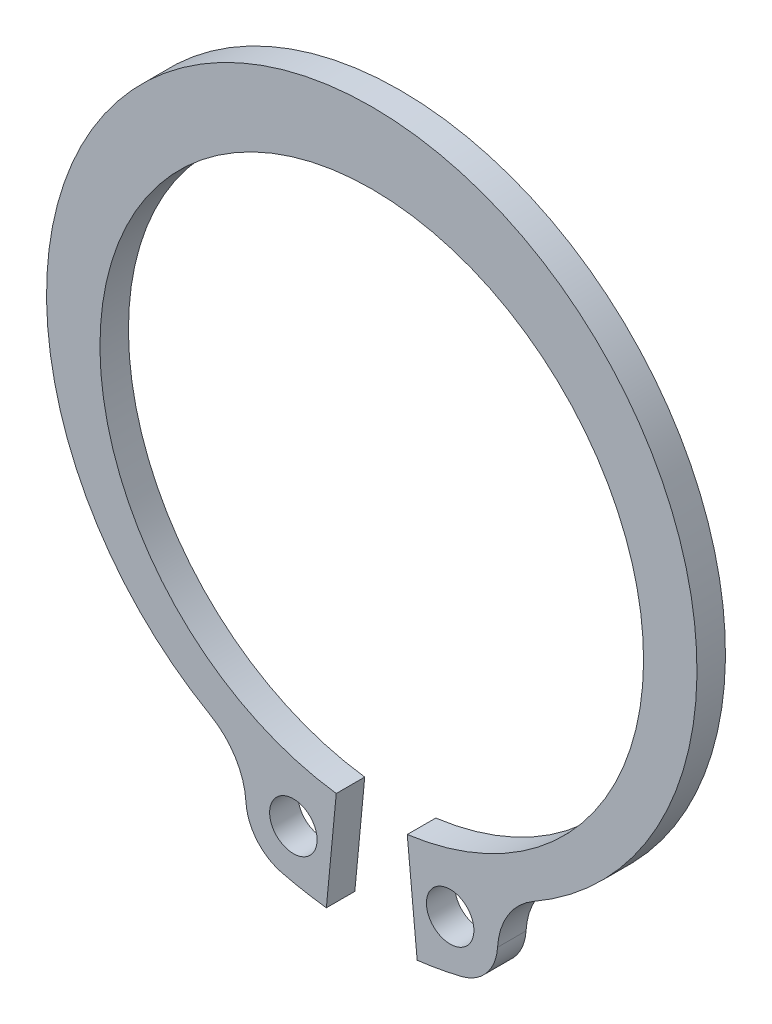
ISO-10303-21;
HEADER;
FILE_DESCRIPTION(('STEP AP214'),'2;1');
FILE_NAME('part.step','',(''),(''),'','','');
FILE_SCHEMA(('AUTOMOTIVE_DESIGN { 1 0 10303 214 1 1 1 1 }'));
ENDSEC;
DATA;
#1=APPLICATION_CONTEXT('core data for automotive mechanical design processes');
#2=APPLICATION_PROTOCOL_DEFINITION('international standard','automotive_design',2000,#1);
#3=PRODUCT_CONTEXT('',#1,'mechanical');
#4=PRODUCT('Part','Part','',(#3));
#5=PRODUCT_RELATED_PRODUCT_CATEGORY('part','',(#4));
#6=PRODUCT_DEFINITION_FORMATION('','',#4);
#7=PRODUCT_DEFINITION_CONTEXT('part definition',#1,'design');
#8=PRODUCT_DEFINITION('design','',#6,#7);
#9=PRODUCT_DEFINITION_SHAPE('','',#8);
#10=(LENGTH_UNIT() NAMED_UNIT(*) SI_UNIT(.MILLI.,.METRE.));
#11=(NAMED_UNIT(*) PLANE_ANGLE_UNIT() SI_UNIT($,.RADIAN.));
#12=(NAMED_UNIT(*) SI_UNIT($,.STERADIAN.) SOLID_ANGLE_UNIT());
#13=UNCERTAINTY_MEASURE_WITH_UNIT(LENGTH_MEASURE(1.E-05),#10,'distance_accuracy_value','');
#14=(GEOMETRIC_REPRESENTATION_CONTEXT(3) GLOBAL_UNCERTAINTY_ASSIGNED_CONTEXT((#13)) GLOBAL_UNIT_ASSIGNED_CONTEXT((#10,
#11,#12)) REPRESENTATION_CONTEXT('',''));
#15=CARTESIAN_POINT('',(0.,0.,0.));
#16=DIRECTION('',(0.,0.,1.));
#17=DIRECTION('',(1.,0.,0.));
#18=AXIS2_PLACEMENT_3D('',#15,#16,#17);
#19=CARTESIAN_POINT('',(0.,0.,1.2));
#20=DIRECTION('',(0.,0.,1.));
#21=DIRECTION('',(1.,0.,0.));
#22=AXIS2_PLACEMENT_3D('',#19,#20,#21);
#23=PLANE('',#22);
#24=CARTESIAN_POINT('',(-3.30221734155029,-13.4484450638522,1.2));
#25=DIRECTION('',(0.,0.,1.));
#26=DIRECTION('',(-1.,0.,0.));
#27=AXIS2_PLACEMENT_3D('',#24,#25,#26);
#28=CIRCLE('',#27,1.);
#29=CARTESIAN_POINT('',(-4.30221734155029,-13.4484450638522,1.2));
#30=VERTEX_POINT('',#29);
#31=EDGE_CURVE('E133',#30,#30,#28,.T.);
#32=ORIENTED_EDGE('',*,*,#31,.F.);
#33=EDGE_LOOP('',(#32));
#34=FACE_BOUND('',#33,.T.);
#35=CARTESIAN_POINT('',(0.,0.,1.2));
#36=DIRECTION('',(0.,0.,-1.));
#37=DIRECTION('',(1.,0.,0.));
#38=AXIS2_PLACEMENT_3D('',#35,#36,#37);
#39=CIRCLE('',#38,11.45);
#40=CARTESIAN_POINT('',(-1.49536024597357,-11.3519336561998,1.2));
#41=VERTEX_POINT('',#40);
#42=CARTESIAN_POINT('',(1.49536024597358,-11.3519336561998,1.2));
#43=VERTEX_POINT('',#42);
#44=EDGE_CURVE('E155',#41,#43,#39,.T.);
#45=ORIENTED_EDGE('',*,*,#44,.T.);
#46=DIRECTION('',(0.0947869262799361,-0.995497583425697,0.));
#47=VECTOR('',#46,1.);
#48=CARTESIAN_POINT('',(1.49536024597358,-11.3519336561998,1.2));
#49=LINE('',#48,#47);
#50=CARTESIAN_POINT('',(1.9124227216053,-15.7321230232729,1.2));
#51=VERTEX_POINT('',#50);
#52=EDGE_CURVE('E128',#43,#51,#49,.T.);
#53=ORIENTED_EDGE('',*,*,#52,.T.);
#54=CARTESIAN_POINT('',(0.,0.,1.2));
#55=DIRECTION('',(0.,0.,1.));
#56=DIRECTION('',(1.,0.,0.));
#57=AXIS2_PLACEMENT_3D('',#54,#55,#56);
#58=CIRCLE('',#57,15.8479353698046);
#59=CARTESIAN_POINT('',(3.77914292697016,-15.3907483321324,1.2));
#60=VERTEX_POINT('',#59);
#61=EDGE_CURVE('E159',#51,#60,#58,.T.);
#62=ORIENTED_EDGE('',*,*,#61,.T.);
#63=CARTESIAN_POINT('',(3.30221734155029,-13.4484450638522,1.2));
#64=DIRECTION('',(0.,0.,1.));
#65=DIRECTION('',(1.,0.,0.));
#66=AXIS2_PLACEMENT_3D('',#63,#64,#65);
#67=CIRCLE('',#66,2.);
#68=CARTESIAN_POINT('',(5.29869284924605,-13.5671276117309,1.2));
#69=VERTEX_POINT('',#68);
#70=EDGE_CURVE('E161',#60,#69,#67,.T.);
#71=ORIENTED_EDGE('',*,*,#70,.T.);
#72=CARTESIAN_POINT('',(8.29340611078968,-13.745151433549,1.2));
#73=DIRECTION('',(0.,0.,-1.));
#74=DIRECTION('',(1.,0.,0.));
#75=AXIS2_PLACEMENT_3D('',#72,#73,#74);
#76=CIRCLE('',#75,3.);
#77=CARTESIAN_POINT('',(6.80357267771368,-11.1412320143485,1.2));
#78=VERTEX_POINT('',#77);
#79=EDGE_CURVE('E163',#69,#78,#76,.T.);
#80=ORIENTED_EDGE('',*,*,#79,.T.);
#81=CARTESIAN_POINT('',(0.,0.75,1.2));
#82=DIRECTION('',(0.,0.,1.));
#83=DIRECTION('',(1.,0.,0.));
#84=AXIS2_PLACEMENT_3D('',#81,#82,#83);
#85=CIRCLE('',#84,13.7);
#86=CARTESIAN_POINT('',(-6.80357267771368,-11.1412320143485,1.2));
#87=VERTEX_POINT('',#86);
#88=EDGE_CURVE('E165',#78,#87,#85,.T.);
#89=ORIENTED_EDGE('',*,*,#88,.T.);
#90=CARTESIAN_POINT('',(-8.29340611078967,-13.745151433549,1.2));
#91=DIRECTION('',(0.,0.,-1.));
#92=DIRECTION('',(-1.,0.,0.));
#93=AXIS2_PLACEMENT_3D('',#90,#91,#92);
#94=CIRCLE('',#93,3.);
#95=CARTESIAN_POINT('',(-5.29869284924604,-13.5671276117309,1.2));
#96=VERTEX_POINT('',#95);
#97=EDGE_CURVE('E168',#87,#96,#94,.T.);
#98=ORIENTED_EDGE('',*,*,#97,.T.);
#99=CARTESIAN_POINT('',(-3.30221734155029,-13.4484450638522,1.2));
#100=DIRECTION('',(0.,0.,1.));
#101=DIRECTION('',(-1.,0.,0.));
#102=AXIS2_PLACEMENT_3D('',#99,#100,#101);
#103=CIRCLE('',#102,2.);
#104=CARTESIAN_POINT('',(-3.77914292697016,-15.3907483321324,1.2));
#105=VERTEX_POINT('',#104);
#106=EDGE_CURVE('E170',#96,#105,#103,.T.);
#107=ORIENTED_EDGE('',*,*,#106,.T.);
#108=CARTESIAN_POINT('',(0.,0.,1.2));
#109=DIRECTION('',(0.,0.,1.));
#110=DIRECTION('',(-1.,0.,0.));
#111=AXIS2_PLACEMENT_3D('',#108,#109,#110);
#112=CIRCLE('',#111,15.8479353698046);
#113=CARTESIAN_POINT('',(-1.91242272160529,-15.7321230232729,1.2));
#114=VERTEX_POINT('',#113);
#115=EDGE_CURVE('E57',#105,#114,#112,.T.);
#116=ORIENTED_EDGE('',*,*,#115,.T.);
#117=DIRECTION('',(0.0947869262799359,0.995497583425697,0.));
#118=VECTOR('',#117,1.);
#119=CARTESIAN_POINT('',(-1.49536024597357,-11.3519336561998,1.2));
#120=LINE('',#119,#118);
#121=EDGE_CURVE('E52',#114,#41,#120,.T.);
#122=ORIENTED_EDGE('',*,*,#121,.T.);
#123=EDGE_LOOP('',(#45,#53,#62,#71,#80,#89,#98,#107,#116,#122));
#124=FACE_BOUND('',#123,.T.);
#125=CARTESIAN_POINT('',(3.30221734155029,-13.4484450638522,1.2));
#126=DIRECTION('',(0.,0.,1.));
#127=DIRECTION('',(1.,0.,0.));
#128=AXIS2_PLACEMENT_3D('',#125,#126,#127);
#129=CIRCLE('',#128,1.);
#130=CARTESIAN_POINT('',(4.30221734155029,-13.4484450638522,1.2));
#131=VERTEX_POINT('',#130);
#132=EDGE_CURVE('E257',#131,#131,#129,.T.);
#133=ORIENTED_EDGE('',*,*,#132,.F.);
#134=EDGE_LOOP('',(#133));
#135=FACE_BOUND('',#134,.T.);
#136=ADVANCED_FACE('F37',(#34,#124,#135),#23,.T.);
#137=CARTESIAN_POINT('',(0.,0.,0.));
#138=DIRECTION('',(0.,0.,1.));
#139=DIRECTION('',(1.,0.,0.));
#140=AXIS2_PLACEMENT_3D('',#137,#138,#139);
#141=PLANE('',#140);
#142=CARTESIAN_POINT('',(-3.30221734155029,-13.4484450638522,0.));
#143=DIRECTION('',(0.,0.,1.));
#144=DIRECTION('',(-1.,0.,0.));
#145=AXIS2_PLACEMENT_3D('',#142,#143,#144);
#146=CIRCLE('',#145,1.);
#147=CARTESIAN_POINT('',(-4.30221734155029,-13.4484450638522,0.));
#148=VERTEX_POINT('',#147);
#149=EDGE_CURVE('E136',#148,#148,#146,.T.);
#150=ORIENTED_EDGE('',*,*,#149,.T.);
#151=EDGE_LOOP('',(#150));
#152=FACE_BOUND('',#151,.T.);
#153=CARTESIAN_POINT('',(0.,0.,0.));
#154=DIRECTION('',(0.,0.,-1.));
#155=DIRECTION('',(1.,0.,0.));
#156=AXIS2_PLACEMENT_3D('',#153,#154,#155);
#157=CIRCLE('',#156,11.45);
#158=CARTESIAN_POINT('',(-1.49536024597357,-11.3519336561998,0.));
#159=VERTEX_POINT('',#158);
#160=CARTESIAN_POINT('',(1.49536024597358,-11.3519336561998,0.));
#161=VERTEX_POINT('',#160);
#162=EDGE_CURVE('E119',#159,#161,#157,.T.);
#163=ORIENTED_EDGE('',*,*,#162,.F.);
#164=DIRECTION('',(0.0947869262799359,0.995497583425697,0.));
#165=VECTOR('',#164,1.);
#166=CARTESIAN_POINT('',(-1.49536024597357,-11.3519336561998,0.));
#167=LINE('',#166,#165);
#168=CARTESIAN_POINT('',(-1.91242272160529,-15.7321230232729,0.));
#169=VERTEX_POINT('',#168);
#170=EDGE_CURVE('E153',#169,#159,#167,.T.);
#171=ORIENTED_EDGE('',*,*,#170,.F.);
#172=CARTESIAN_POINT('',(0.,0.,0.));
#173=DIRECTION('',(0.,0.,1.));
#174=DIRECTION('',(-1.,0.,0.));
#175=AXIS2_PLACEMENT_3D('',#172,#173,#174);
#176=CIRCLE('',#175,15.8479353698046);
#177=CARTESIAN_POINT('',(-3.77914292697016,-15.3907483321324,0.));
#178=VERTEX_POINT('',#177);
#179=EDGE_CURVE('E151',#178,#169,#176,.T.);
#180=ORIENTED_EDGE('',*,*,#179,.F.);
#181=CARTESIAN_POINT('',(-3.30221734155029,-13.4484450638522,0.));
#182=DIRECTION('',(0.,0.,1.));
#183=DIRECTION('',(-1.,0.,0.));
#184=AXIS2_PLACEMENT_3D('',#181,#182,#183);
#185=CIRCLE('',#184,2.);
#186=CARTESIAN_POINT('',(-5.29869284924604,-13.5671276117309,0.));
#187=VERTEX_POINT('',#186);
#188=EDGE_CURVE('E149',#187,#178,#185,.T.);
#189=ORIENTED_EDGE('',*,*,#188,.F.);
#190=CARTESIAN_POINT('',(-8.29340611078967,-13.745151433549,0.));
#191=DIRECTION('',(0.,0.,-1.));
#192=DIRECTION('',(-1.,0.,0.));
#193=AXIS2_PLACEMENT_3D('',#190,#191,#192);
#194=CIRCLE('',#193,3.);
#195=CARTESIAN_POINT('',(-6.80357267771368,-11.1412320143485,0.));
#196=VERTEX_POINT('',#195);
#197=EDGE_CURVE('E147',#196,#187,#194,.T.);
#198=ORIENTED_EDGE('',*,*,#197,.F.);
#199=CARTESIAN_POINT('',(0.,0.75,0.));
#200=DIRECTION('',(0.,0.,1.));
#201=DIRECTION('',(1.,0.,0.));
#202=AXIS2_PLACEMENT_3D('',#199,#200,#201);
#203=CIRCLE('',#202,13.7);
#204=CARTESIAN_POINT('',(6.80357267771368,-11.1412320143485,0.));
#205=VERTEX_POINT('',#204);
#206=EDGE_CURVE('E145',#205,#196,#203,.T.);
#207=ORIENTED_EDGE('',*,*,#206,.F.);
#208=CARTESIAN_POINT('',(8.29340611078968,-13.745151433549,0.));
#209=DIRECTION('',(0.,0.,-1.));
#210=DIRECTION('',(1.,0.,0.));
#211=AXIS2_PLACEMENT_3D('',#208,#209,#210);
#212=CIRCLE('',#211,3.);
#213=CARTESIAN_POINT('',(5.29869284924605,-13.5671276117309,0.));
#214=VERTEX_POINT('',#213);
#215=EDGE_CURVE('E143',#214,#205,#212,.T.);
#216=ORIENTED_EDGE('',*,*,#215,.F.);
#217=CARTESIAN_POINT('',(3.30221734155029,-13.4484450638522,0.));
#218=DIRECTION('',(0.,0.,1.));
#219=DIRECTION('',(1.,0.,0.));
#220=AXIS2_PLACEMENT_3D('',#217,#218,#219);
#221=CIRCLE('',#220,2.);
#222=CARTESIAN_POINT('',(3.77914292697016,-15.3907483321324,0.));
#223=VERTEX_POINT('',#222);
#224=EDGE_CURVE('E141',#223,#214,#221,.T.);
#225=ORIENTED_EDGE('',*,*,#224,.F.);
#226=CARTESIAN_POINT('',(0.,0.,0.));
#227=DIRECTION('',(0.,0.,1.));
#228=DIRECTION('',(1.,0.,0.));
#229=AXIS2_PLACEMENT_3D('',#226,#227,#228);
#230=CIRCLE('',#229,15.8479353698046);
#231=CARTESIAN_POINT('',(1.9124227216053,-15.7321230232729,0.));
#232=VERTEX_POINT('',#231);
#233=EDGE_CURVE('E121',#232,#223,#230,.T.);
#234=ORIENTED_EDGE('',*,*,#233,.F.);
#235=DIRECTION('',(0.0947869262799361,-0.995497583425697,0.));
#236=VECTOR('',#235,1.);
#237=CARTESIAN_POINT('',(1.49536024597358,-11.3519336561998,0.));
#238=LINE('',#237,#236);
#239=EDGE_CURVE('E114',#161,#232,#238,.T.);
#240=ORIENTED_EDGE('',*,*,#239,.F.);
#241=EDGE_LOOP('',(#163,#171,#180,#189,#198,#207,#216,#225,#234,#240));
#242=FACE_BOUND('',#241,.T.);
#243=CARTESIAN_POINT('',(3.30221734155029,-13.4484450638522,0.));
#244=DIRECTION('',(0.,0.,1.));
#245=DIRECTION('',(1.,0.,0.));
#246=AXIS2_PLACEMENT_3D('',#243,#244,#245);
#247=CIRCLE('',#246,1.);
#248=CARTESIAN_POINT('',(4.30221734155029,-13.4484450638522,0.));
#249=VERTEX_POINT('',#248);
#250=EDGE_CURVE('E260',#249,#249,#247,.T.);
#251=ORIENTED_EDGE('',*,*,#250,.T.);
#252=EDGE_LOOP('',(#251));
#253=FACE_BOUND('',#252,.T.);
#254=ADVANCED_FACE('F115',(#152,#242,#253),#141,.F.);
#255=CARTESIAN_POINT('',(0.,0.,1.2));
#256=DIRECTION('',(0.,0.,-1.));
#257=DIRECTION('',(-1.,0.,0.));
#258=AXIS2_PLACEMENT_3D('',#255,#256,#257);
#259=CYLINDRICAL_SURFACE('',#258,11.45);
#260=ORIENTED_EDGE('',*,*,#162,.T.);
#261=DIRECTION('',(0.,0.,-1.));
#262=VECTOR('',#261,1.);
#263=CARTESIAN_POINT('',(1.49536024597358,-11.3519336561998,1.2));
#264=LINE('',#263,#262);
#265=EDGE_CURVE('E11',#43,#161,#264,.T.);
#266=ORIENTED_EDGE('',*,*,#265,.F.);
#267=ORIENTED_EDGE('',*,*,#44,.F.);
#268=DIRECTION('',(0.,0.,-1.));
#269=VECTOR('',#268,1.);
#270=CARTESIAN_POINT('',(-1.49536024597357,-11.3519336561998,1.2));
#271=LINE('',#270,#269);
#272=EDGE_CURVE('E132',#41,#159,#271,.T.);
#273=ORIENTED_EDGE('',*,*,#272,.T.);
#274=EDGE_LOOP('',(#260,#266,#267,#273));
#275=FACE_BOUND('',#274,.T.);
#276=ADVANCED_FACE('F39',(#275),#259,.F.);
#277=CARTESIAN_POINT('',(1.49536024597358,-11.3519336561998,1.2));
#278=DIRECTION('',(0.995497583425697,0.0947869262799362,0.));
#279=DIRECTION('',(-0.0947869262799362,0.995497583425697,0.));
#280=AXIS2_PLACEMENT_3D('',#277,#278,#279);
#281=PLANE('',#280);
#282=ORIENTED_EDGE('',*,*,#239,.T.);
#283=DIRECTION('',(0.,0.,-1.));
#284=VECTOR('',#283,1.);
#285=CARTESIAN_POINT('',(1.9124227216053,-15.7321230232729,1.2));
#286=LINE('',#285,#284);
#287=EDGE_CURVE('E45',#51,#232,#286,.T.);
#288=ORIENTED_EDGE('',*,*,#287,.F.);
#289=ORIENTED_EDGE('',*,*,#52,.F.);
#290=ORIENTED_EDGE('',*,*,#265,.T.);
#291=EDGE_LOOP('',(#282,#288,#289,#290));
#292=FACE_BOUND('',#291,.T.);
#293=ADVANCED_FACE('F127',(#292),#281,.F.);
#294=CARTESIAN_POINT('',(0.,0.,1.2));
#295=DIRECTION('',(0.,0.,-1.));
#296=DIRECTION('',(-1.,0.,0.));
#297=AXIS2_PLACEMENT_3D('',#294,#295,#296);
#298=CYLINDRICAL_SURFACE('',#297,15.8479353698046);
#299=ORIENTED_EDGE('',*,*,#233,.T.);
#300=DIRECTION('',(0.,0.,-1.));
#301=VECTOR('',#300,1.);
#302=CARTESIAN_POINT('',(3.77914292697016,-15.3907483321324,1.2));
#303=LINE('',#302,#301);
#304=EDGE_CURVE('E193',#60,#223,#303,.T.);
#305=ORIENTED_EDGE('',*,*,#304,.F.);
#306=ORIENTED_EDGE('',*,*,#61,.F.);
#307=ORIENTED_EDGE('',*,*,#287,.T.);
#308=EDGE_LOOP('',(#299,#305,#306,#307));
#309=FACE_BOUND('',#308,.T.);
#310=ADVANCED_FACE('F197',(#309),#298,.T.);
#311=CARTESIAN_POINT('',(3.30221734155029,-13.4484450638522,1.2));
#312=DIRECTION('',(0.,0.,-1.));
#313=DIRECTION('',(-1.,0.,0.));
#314=AXIS2_PLACEMENT_3D('',#311,#312,#313);
#315=CYLINDRICAL_SURFACE('',#314,2.);
#316=ORIENTED_EDGE('',*,*,#224,.T.);
#317=DIRECTION('',(0.,0.,-1.));
#318=VECTOR('',#317,1.);
#319=CARTESIAN_POINT('',(5.29869284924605,-13.5671276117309,1.2));
#320=LINE('',#319,#318);
#321=EDGE_CURVE('E190',#69,#214,#320,.T.);
#322=ORIENTED_EDGE('',*,*,#321,.F.);
#323=ORIENTED_EDGE('',*,*,#70,.F.);
#324=ORIENTED_EDGE('',*,*,#304,.T.);
#325=EDGE_LOOP('',(#316,#322,#323,#324));
#326=FACE_BOUND('',#325,.T.);
#327=ADVANCED_FACE('F205',(#326),#315,.T.);
#328=CARTESIAN_POINT('',(8.29340611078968,-13.745151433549,1.2));
#329=DIRECTION('',(0.,0.,-1.));
#330=DIRECTION('',(-1.,0.,0.));
#331=AXIS2_PLACEMENT_3D('',#328,#329,#330);
#332=CYLINDRICAL_SURFACE('',#331,3.);
#333=ORIENTED_EDGE('',*,*,#215,.T.);
#334=DIRECTION('',(0.,0.,-1.));
#335=VECTOR('',#334,1.);
#336=CARTESIAN_POINT('',(6.80357267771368,-11.1412320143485,1.2));
#337=LINE('',#336,#335);
#338=EDGE_CURVE('E187',#78,#205,#337,.T.);
#339=ORIENTED_EDGE('',*,*,#338,.F.);
#340=ORIENTED_EDGE('',*,*,#79,.F.);
#341=ORIENTED_EDGE('',*,*,#321,.T.);
#342=EDGE_LOOP('',(#333,#339,#340,#341));
#343=FACE_BOUND('',#342,.T.);
#344=ADVANCED_FACE('F208',(#343),#332,.F.);
#345=CARTESIAN_POINT('',(0.,0.75,1.2));
#346=DIRECTION('',(0.,0.,-1.));
#347=DIRECTION('',(-1.,0.,0.));
#348=AXIS2_PLACEMENT_3D('',#345,#346,#347);
#349=CYLINDRICAL_SURFACE('',#348,13.7);
#350=ORIENTED_EDGE('',*,*,#206,.T.);
#351=DIRECTION('',(0.,0.,-1.));
#352=VECTOR('',#351,1.);
#353=CARTESIAN_POINT('',(-6.80357267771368,-11.1412320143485,1.2));
#354=LINE('',#353,#352);
#355=EDGE_CURVE('E184',#87,#196,#354,.T.);
#356=ORIENTED_EDGE('',*,*,#355,.F.);
#357=ORIENTED_EDGE('',*,*,#88,.F.);
#358=ORIENTED_EDGE('',*,*,#338,.T.);
#359=EDGE_LOOP('',(#350,#356,#357,#358));
#360=FACE_BOUND('',#359,.T.);
#361=ADVANCED_FACE('F213',(#360),#349,.T.);
#362=CARTESIAN_POINT('',(-8.29340611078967,-13.745151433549,1.2));
#363=DIRECTION('',(0.,0.,-1.));
#364=DIRECTION('',(-1.,0.,0.));
#365=AXIS2_PLACEMENT_3D('',#362,#363,#364);
#366=CYLINDRICAL_SURFACE('',#365,3.);
#367=ORIENTED_EDGE('',*,*,#197,.T.);
#368=DIRECTION('',(0.,0.,-1.));
#369=VECTOR('',#368,1.);
#370=CARTESIAN_POINT('',(-5.29869284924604,-13.5671276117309,1.2));
#371=LINE('',#370,#369);
#372=EDGE_CURVE('E181',#96,#187,#371,.T.);
#373=ORIENTED_EDGE('',*,*,#372,.F.);
#374=ORIENTED_EDGE('',*,*,#97,.F.);
#375=ORIENTED_EDGE('',*,*,#355,.T.);
#376=EDGE_LOOP('',(#367,#373,#374,#375));
#377=FACE_BOUND('',#376,.T.);
#378=ADVANCED_FACE('F219',(#377),#366,.F.);
#379=CARTESIAN_POINT('',(-3.30221734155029,-13.4484450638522,1.2));
#380=DIRECTION('',(0.,0.,-1.));
#381=DIRECTION('',(-1.,0.,0.));
#382=AXIS2_PLACEMENT_3D('',#379,#380,#381);
#383=CYLINDRICAL_SURFACE('',#382,2.);
#384=ORIENTED_EDGE('',*,*,#188,.T.);
#385=DIRECTION('',(0.,0.,-1.));
#386=VECTOR('',#385,1.);
#387=CARTESIAN_POINT('',(-3.77914292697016,-15.3907483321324,1.2));
#388=LINE('',#387,#386);
#389=EDGE_CURVE('E178',#105,#178,#388,.T.);
#390=ORIENTED_EDGE('',*,*,#389,.F.);
#391=ORIENTED_EDGE('',*,*,#106,.F.);
#392=ORIENTED_EDGE('',*,*,#372,.T.);
#393=EDGE_LOOP('',(#384,#390,#391,#392));
#394=FACE_BOUND('',#393,.T.);
#395=ADVANCED_FACE('F223',(#394),#383,.T.);
#396=CARTESIAN_POINT('',(0.,0.,1.2));
#397=DIRECTION('',(0.,0.,-1.));
#398=DIRECTION('',(-1.,0.,0.));
#399=AXIS2_PLACEMENT_3D('',#396,#397,#398);
#400=CYLINDRICAL_SURFACE('',#399,15.8479353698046);
#401=ORIENTED_EDGE('',*,*,#179,.T.);
#402=DIRECTION('',(0.,0.,-1.));
#403=VECTOR('',#402,1.);
#404=CARTESIAN_POINT('',(-1.91242272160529,-15.7321230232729,1.2));
#405=LINE('',#404,#403);
#406=EDGE_CURVE('E175',#114,#169,#405,.T.);
#407=ORIENTED_EDGE('',*,*,#406,.F.);
#408=ORIENTED_EDGE('',*,*,#115,.F.);
#409=ORIENTED_EDGE('',*,*,#389,.T.);
#410=EDGE_LOOP('',(#401,#407,#408,#409));
#411=FACE_BOUND('',#410,.T.);
#412=ADVANCED_FACE('F226',(#411),#400,.T.);
#413=CARTESIAN_POINT('',(-1.49536024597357,-11.3519336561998,1.2));
#414=DIRECTION('',(-0.995497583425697,0.0947869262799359,0.));
#415=DIRECTION('',(-0.0947869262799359,-0.995497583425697,0.));
#416=AXIS2_PLACEMENT_3D('',#413,#414,#415);
#417=PLANE('',#416);
#418=ORIENTED_EDGE('',*,*,#170,.T.);
#419=ORIENTED_EDGE('',*,*,#272,.F.);
#420=ORIENTED_EDGE('',*,*,#121,.F.);
#421=ORIENTED_EDGE('',*,*,#406,.T.);
#422=EDGE_LOOP('',(#418,#419,#420,#421));
#423=FACE_BOUND('',#422,.T.);
#424=ADVANCED_FACE('F228',(#423),#417,.F.);
#425=CARTESIAN_POINT('',(-3.30221734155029,-13.4484450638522,1.2));
#426=DIRECTION('',(0.,0.,-1.));
#427=DIRECTION('',(-1.,0.,0.));
#428=AXIS2_PLACEMENT_3D('',#425,#426,#427);
#429=CYLINDRICAL_SURFACE('',#428,1.);
#430=ORIENTED_EDGE('',*,*,#31,.T.);
#431=EDGE_LOOP('',(#430));
#432=FACE_BOUND('',#431,.T.);
#433=ORIENTED_EDGE('',*,*,#149,.F.);
#434=EDGE_LOOP('',(#433));
#435=FACE_BOUND('',#434,.T.);
#436=ADVANCED_FACE('F230',(#432,#435),#429,.F.);
#437=CARTESIAN_POINT('',(3.30221734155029,-13.4484450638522,1.2));
#438=DIRECTION('',(0.,0.,-1.));
#439=DIRECTION('',(-1.,0.,0.));
#440=AXIS2_PLACEMENT_3D('',#437,#438,#439);
#441=CYLINDRICAL_SURFACE('',#440,1.);
#442=ORIENTED_EDGE('',*,*,#132,.T.);
#443=EDGE_LOOP('',(#442));
#444=FACE_BOUND('',#443,.T.);
#445=ORIENTED_EDGE('',*,*,#250,.F.);
#446=EDGE_LOOP('',(#445));
#447=FACE_BOUND('',#446,.T.);
#448=ADVANCED_FACE('F236',(#444,#447),#441,.F.);
#449=CLOSED_SHELL('',(#136,#254,#276,#293,#310,#327,#344,#361,#378,#395,#412,#424,#436,#448));
#450=MANIFOLD_SOLID_BREP('B2',#449);
#451=ADVANCED_BREP_SHAPE_REPRESENTATION('',(#18,#450),#14);
#452=SHAPE_DEFINITION_REPRESENTATION(#9,#451);
ENDSEC;
END-ISO-10303-21;
